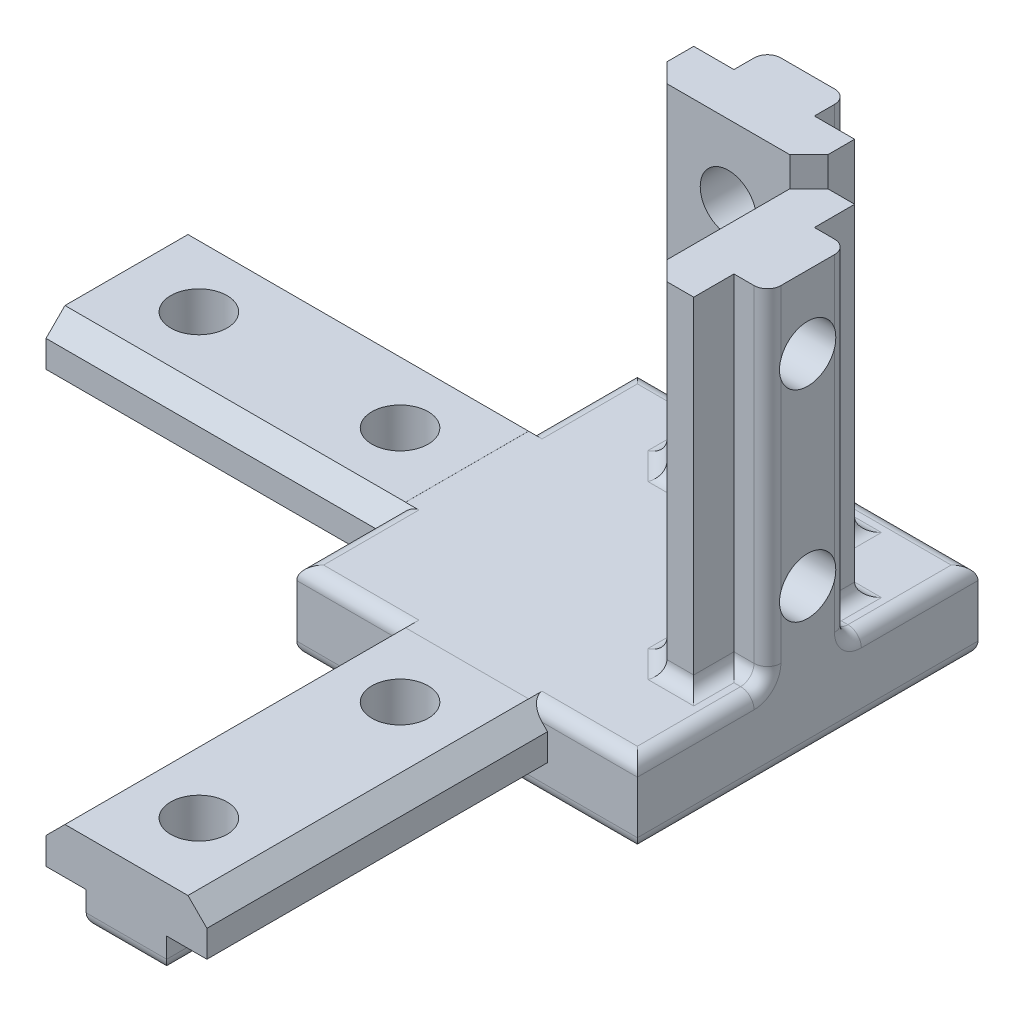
from build123d import *

# Parameters (mm, degrees)
SKETCH1_W             = 25.4
SKETCH1_H             = 25.4
BOSS_EXTRUDE1_DEPTH   = 5.91
BOSS_EXTRUDE2_DEPTH   = 25.4
BOSS_EXTRUDE3_DEPTH   = 25.4
BOSS_EXTRUDE4_DEPTH   = 25.4
FILLET2_R             = 1
M5X0_8_TAPPED_HOLE2_D = 4.2
M5X0_8_TAPPED_HOLE3_D = 4.2
M5X0_8_TAPPED_HOLE4_D = 4.2


with BuildPart() as part:
    # Sketch1 → Boss-Extrude1 (new body)
    with BuildSketch(Plane(origin=(0, 0, 0), x_dir=(1, 0, 0), z_dir=(0, 1, 0))):
        Rectangle(SKETCH1_W, SKETCH1_H)
    extrude(amount=BOSS_EXTRUDE1_DEPTH)

    # Sketch2 → Boss-Extrude2 (add)
    with BuildSketch(Plane.XY.offset(12.7)):
        Polygon((-3, 0), (3, 0), (3, 2.5), (6, 2.5), (6, 4.5), (4.585786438, 5.914213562), (-4.585786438, 5.914213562), (-6, 4.5), (-6, 2.5), (-3, 2.5), align=None)
    extrude(amount=BOSS_EXTRUDE2_DEPTH)

    # Sketch3 → Boss-Extrude3 (add)
    with BuildSketch(Plane.ZY.offset(12.7)):
        Polygon((-3, 0), (3, 0), (3, 2.5), (6, 2.5), (6, 4.5), (4.585786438, 5.914213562), (-4.585786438, 5.914213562), (-6, 4.5), (-6, 2.5), (-3, 2.5), align=None)
    extrude(amount=BOSS_EXTRUDE3_DEPTH)

    # Sketch5 → Boss-Extrude4 (add)
    with BuildSketch(Plane(origin=(0, 5.91, 0), x_dir=(1, 0, 0), z_dir=(0, 1, 0))):
        Polygon((3, 12.7), (-3, 12.7), (-3, 10.2), (-6, 10.2), (-6, 8.2), (-4.585786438, 6.785786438), (4.585786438, 6.785786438), (6, 8.2), (6, 10.2), (3, 10.2), align=None)
        Polygon((12.7, -3), (12.7, 3), (10.2, 3), (10.2, 6), (8.2, 6), (6.785786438, 4.585786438), (6.785786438, -4.585786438), (8.2, -6), (10.2, -6), (10.2, -3), align=None)
    extrude(amount=BOSS_EXTRUDE4_DEPTH)

    # Fillet2
    fillet2_edges = [part.edges().sort_by_distance(p)[0] for p in [
        (6.785786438, 5.91, 0),
        (7.492893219, 5.91, 5.292893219),
        (9.2, 5.91, 6),
        (10.2, 5.91, 4.5),
        (11.45, 5.91, 3),
        (12.7, 18.61, 3),
        (-12.7, 5.91, -8.645),
        (7.85, 0, 12.7),
        (8.645, 5.91, 12.7),
        (-8.645, 5.91, 12.7),
        (3, 0, 25.4),
        (-3, 0, 25.4),
        (0, 0, 38.1),
        (-12.7, 0, 7.85),
        (-12.7, 5.91, 8.645),
        (-25.4, 0, 3),
        (12.7, 5.91, 7.85),
        (-7.85, 0, 12.7),
        (-12.7, 0, -7.85),
        (-25.4, 0, -3),
        (-38.1, 0, 0),
        (0, 0, -12.7),
        (12.7, 0, 0),
        (12.7, 5.91, -7.85),
        (-7.85, 5.91, -12.7),
        (-3, 5.91, -11.45),
        (-3, 18.61, -12.7),
        (-4.5, 5.91, -10.2),
        (-6, 5.91, -9.2),
        (-5.292893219, 5.91, -7.492893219),
        (0, 5.91, -6.785786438),
        (5.292893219, 5.91, -7.492893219),
        (6, 5.91, -9.2),
        (4.5, 5.91, -10.2),
        (3, 5.91, -11.45),
        (3, 18.61, -12.7),
        (7.85, 5.91, -12.7),
        (11.45, 5.91, -3),
        (12.7, 18.61, -3),
        (10.2, 5.91, -4.5),
        (9.2, 5.91, -6),
        (7.492893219, 5.91, -5.292893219),
    ]]
    fillet(fillet2_edges, radius=FILLET2_R)

    # M5x0.8 Tapped Hole2 (through all)
    with Locations(Plane(origin=(0, 0, 0), x_dir=(-1, 0, 0), z_dir=(0, -1, 0))):
        with Locations((0, -17.7), (0, -32.7), (17.7, 0), (32.7, 0)):
            Hole(M5X0_8_TAPPED_HOLE2_D / 2)

    # M5x0.8 Tapped Hole3 (through all)
    with Locations(Plane(origin=(12.7, 0, 0), x_dir=(0, 0, -1), z_dir=(1, 0, 0))):
        with Locations((0, 10.91), (0, 25.91)):
            Hole(M5X0_8_TAPPED_HOLE3_D / 2)

    # M5x0.8 Tapped Hole4 (through all)
    with Locations(Plane(origin=(0, 0, -12.7), x_dir=(-1, 0, 0), z_dir=(0, 0, -1))):
        with Locations((0, 25.91), (0, 10.91)):
            Hole(M5X0_8_TAPPED_HOLE4_D / 2)


solid = part.part
